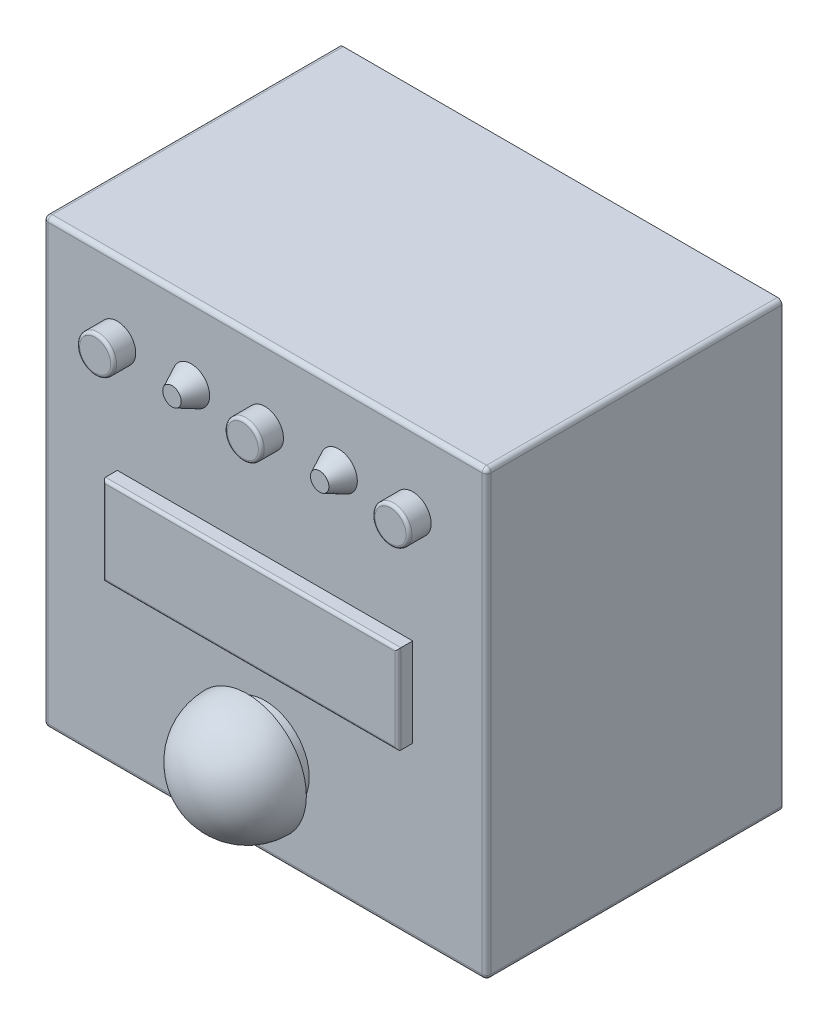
ISO-10303-21;
HEADER;
FILE_DESCRIPTION(('STEP AP214'),'2;1');
FILE_NAME('part.step','',(''),(''),'','','');
FILE_SCHEMA(('AUTOMOTIVE_DESIGN { 1 0 10303 214 1 1 1 1 }'));
ENDSEC;
DATA;
#1=APPLICATION_CONTEXT('core data for automotive mechanical design processes');
#2=APPLICATION_PROTOCOL_DEFINITION('international standard','automotive_design',2000,#1);
#3=PRODUCT_CONTEXT('',#1,'mechanical');
#4=PRODUCT('Part','Part','',(#3));
#5=PRODUCT_RELATED_PRODUCT_CATEGORY('part','',(#4));
#6=PRODUCT_DEFINITION_FORMATION('','',#4);
#7=PRODUCT_DEFINITION_CONTEXT('part definition',#1,'design');
#8=PRODUCT_DEFINITION('design','',#6,#7);
#9=PRODUCT_DEFINITION_SHAPE('','',#8);
#10=(LENGTH_UNIT() NAMED_UNIT(*) SI_UNIT(.MILLI.,.METRE.));
#11=(NAMED_UNIT(*) PLANE_ANGLE_UNIT() SI_UNIT($,.RADIAN.));
#12=(NAMED_UNIT(*) SI_UNIT($,.STERADIAN.) SOLID_ANGLE_UNIT());
#13=UNCERTAINTY_MEASURE_WITH_UNIT(LENGTH_MEASURE(1.E-05),#10,'distance_accuracy_value','');
#14=(GEOMETRIC_REPRESENTATION_CONTEXT(3) GLOBAL_UNCERTAINTY_ASSIGNED_CONTEXT((#13)) GLOBAL_UNIT_ASSIGNED_CONTEXT((#10,
#11,#12)) REPRESENTATION_CONTEXT('',''));
#15=CARTESIAN_POINT('',(0.,0.,0.));
#16=DIRECTION('',(0.,0.,1.));
#17=DIRECTION('',(1.,0.,0.));
#18=AXIS2_PLACEMENT_3D('',#15,#16,#17);
#19=CARTESIAN_POINT('',(0.,300.,200.));
#20=DIRECTION('',(0.,0.,-1.));
#21=DIRECTION('',(-1.,0.,0.));
#22=AXIS2_PLACEMENT_3D('',#19,#20,#21);
#23=PLANE('',#22);
#24=CARTESIAN_POINT('',(100.,250.,200.));
#25=DIRECTION('',(0.,0.,-1.));
#26=DIRECTION('',(-1.,0.,0.));
#27=AXIS2_PLACEMENT_3D('',#24,#25,#26);
#28=CIRCLE('',#27,12.5);
#29=CARTESIAN_POINT('',(87.5,250.,200.));
#30=VERTEX_POINT('',#29);
#31=EDGE_CURVE('E48',#30,#30,#28,.F.);
#32=ORIENTED_EDGE('',*,*,#31,.F.);
#33=EDGE_LOOP('',(#32));
#34=FACE_BOUND('',#33,.T.);
#35=DIRECTION('',(0.,-1.,0.));
#36=VECTOR('',#35,1.);
#37=CARTESIAN_POINT('',(3.,300.,200.));
#38=LINE('',#37,#36);
#39=CARTESIAN_POINT('',(3.,297.,200.));
#40=VERTEX_POINT('',#39);
#41=CARTESIAN_POINT('',(3.,3.,200.));
#42=VERTEX_POINT('',#41);
#43=EDGE_CURVE('E326',#40,#42,#38,.T.);
#44=ORIENTED_EDGE('',*,*,#43,.T.);
#45=DIRECTION('',(1.,0.,0.));
#46=VECTOR('',#45,1.);
#47=CARTESIAN_POINT('',(0.,3.,200.));
#48=LINE('',#47,#46);
#49=CARTESIAN_POINT('',(297.,3.,200.));
#50=VERTEX_POINT('',#49);
#51=EDGE_CURVE('E332',#42,#50,#48,.T.);
#52=ORIENTED_EDGE('',*,*,#51,.T.);
#53=DIRECTION('',(0.,1.,0.));
#54=VECTOR('',#53,1.);
#55=CARTESIAN_POINT('',(297.,300.,200.));
#56=LINE('',#55,#54);
#57=CARTESIAN_POINT('',(297.,297.,200.));
#58=VERTEX_POINT('',#57);
#59=EDGE_CURVE('E330',#50,#58,#56,.T.);
#60=ORIENTED_EDGE('',*,*,#59,.T.);
#61=DIRECTION('',(-1.,0.,0.));
#62=VECTOR('',#61,1.);
#63=CARTESIAN_POINT('',(0.,297.,200.));
#64=LINE('',#63,#62);
#65=EDGE_CURVE('E328',#58,#40,#64,.T.);
#66=ORIENTED_EDGE('',*,*,#65,.T.);
#67=EDGE_LOOP('',(#44,#52,#60,#66));
#68=FACE_BOUND('',#67,.T.);
#69=DIRECTION('',(0.,-1.,0.));
#70=VECTOR('',#69,1.);
#71=CARTESIAN_POINT('',(50.,175.,200.));
#72=LINE('',#71,#70);
#73=CARTESIAN_POINT('',(50.,175.,200.));
#74=VERTEX_POINT('',#73);
#75=CARTESIAN_POINT('',(50.,115.,200.));
#76=VERTEX_POINT('',#75);
#77=EDGE_CURVE('E180',#74,#76,#72,.T.);
#78=ORIENTED_EDGE('',*,*,#77,.F.);
#79=DIRECTION('',(-1.,0.,0.));
#80=VECTOR('',#79,1.);
#81=CARTESIAN_POINT('',(50.,175.,200.));
#82=LINE('',#81,#80);
#83=CARTESIAN_POINT('',(250.,175.,200.));
#84=VERTEX_POINT('',#83);
#85=EDGE_CURVE('E187',#84,#74,#82,.T.);
#86=ORIENTED_EDGE('',*,*,#85,.F.);
#87=DIRECTION('',(0.,1.,0.));
#88=VECTOR('',#87,1.);
#89=CARTESIAN_POINT('',(250.,175.,200.));
#90=LINE('',#89,#88);
#91=CARTESIAN_POINT('',(250.,115.,200.));
#92=VERTEX_POINT('',#91);
#93=EDGE_CURVE('E201',#92,#84,#90,.T.);
#94=ORIENTED_EDGE('',*,*,#93,.F.);
#95=DIRECTION('',(1.,0.,0.));
#96=VECTOR('',#95,1.);
#97=CARTESIAN_POINT('',(50.,115.,200.));
#98=LINE('',#97,#96);
#99=EDGE_CURVE('E196',#76,#92,#98,.T.);
#100=ORIENTED_EDGE('',*,*,#99,.F.);
#101=EDGE_LOOP('',(#78,#86,#94,#100));
#102=FACE_BOUND('',#101,.T.);
#103=CARTESIAN_POINT('',(150.,250.,200.));
#104=DIRECTION('',(0.,0.,-1.));
#105=DIRECTION('',(-1.,0.,0.));
#106=AXIS2_PLACEMENT_3D('',#103,#104,#105);
#107=CIRCLE('',#106,12.5);
#108=CARTESIAN_POINT('',(137.5,250.,200.));
#109=VERTEX_POINT('',#108);
#110=EDGE_CURVE('E255',#109,#109,#107,.F.);
#111=ORIENTED_EDGE('',*,*,#110,.F.);
#112=EDGE_LOOP('',(#111));
#113=FACE_BOUND('',#112,.T.);
#114=CARTESIAN_POINT('',(50.,250.,200.));
#115=DIRECTION('',(0.,0.,-1.));
#116=DIRECTION('',(-1.,0.,0.));
#117=AXIS2_PLACEMENT_3D('',#114,#115,#116);
#118=CIRCLE('',#117,12.5);
#119=CARTESIAN_POINT('',(37.5,250.,200.));
#120=VERTEX_POINT('',#119);
#121=EDGE_CURVE('E225',#120,#120,#118,.F.);
#122=ORIENTED_EDGE('',*,*,#121,.F.);
#123=EDGE_LOOP('',(#122));
#124=FACE_BOUND('',#123,.T.);
#125=CARTESIAN_POINT('',(250.,250.,200.));
#126=DIRECTION('',(0.,0.,-1.));
#127=DIRECTION('',(-1.,0.,0.));
#128=AXIS2_PLACEMENT_3D('',#125,#126,#127);
#129=CIRCLE('',#128,12.5);
#130=CARTESIAN_POINT('',(237.5,250.,200.));
#131=VERTEX_POINT('',#130);
#132=EDGE_CURVE('E258',#131,#131,#129,.F.);
#133=ORIENTED_EDGE('',*,*,#132,.F.);
#134=EDGE_LOOP('',(#133));
#135=FACE_BOUND('',#134,.T.);
#136=CARTESIAN_POINT('',(150.,60.,200.));
#137=DIRECTION('',(0.,0.,-1.));
#138=DIRECTION('',(-1.,0.,0.));
#139=AXIS2_PLACEMENT_3D('',#136,#137,#138);
#140=CIRCLE('',#139,30.);
#141=CARTESIAN_POINT('',(120.,60.,200.));
#142=VERTEX_POINT('',#141);
#143=EDGE_CURVE('E296',#142,#142,#140,.F.);
#144=ORIENTED_EDGE('',*,*,#143,.F.);
#145=EDGE_LOOP('',(#144));
#146=FACE_BOUND('',#145,.T.);
#147=CARTESIAN_POINT('',(200.,250.,200.));
#148=DIRECTION('',(0.,0.,-1.));
#149=DIRECTION('',(-1.,0.,0.));
#150=AXIS2_PLACEMENT_3D('',#147,#148,#149);
#151=CIRCLE('',#150,12.5);
#152=CARTESIAN_POINT('',(187.5,250.,200.));
#153=VERTEX_POINT('',#152);
#154=EDGE_CURVE('E13',#153,#153,#151,.F.);
#155=ORIENTED_EDGE('',*,*,#154,.F.);
#156=EDGE_LOOP('',(#155));
#157=FACE_BOUND('',#156,.T.);
#158=ADVANCED_FACE('F39',(#34,#68,#102,#113,#124,#135,#146,#157),#23,.F.);
#159=CARTESIAN_POINT('',(0.,0.,200.));
#160=DIRECTION('',(1.,0.,0.));
#161=DIRECTION('',(0.,0.,-1.));
#162=AXIS2_PLACEMENT_3D('',#159,#160,#161);
#163=PLANE('',#162);
#164=DIRECTION('',(0.,-1.,0.));
#165=VECTOR('',#164,1.);
#166=CARTESIAN_POINT('',(0.,0.,0.));
#167=LINE('',#166,#165);
#168=CARTESIAN_POINT('',(0.,297.,0.));
#169=VERTEX_POINT('',#168);
#170=CARTESIAN_POINT('',(0.,3.,0.));
#171=VERTEX_POINT('',#170);
#172=EDGE_CURVE('E211',#169,#171,#167,.T.);
#173=ORIENTED_EDGE('',*,*,#172,.T.);
#174=DIRECTION('',(0.,0.,-1.));
#175=VECTOR('',#174,1.);
#176=CARTESIAN_POINT('',(0.,3.,200.));
#177=LINE('',#176,#175);
#178=CARTESIAN_POINT('',(0.,3.,197.));
#179=VERTEX_POINT('',#178);
#180=EDGE_CURVE('E318',#171,#179,#177,.F.);
#181=ORIENTED_EDGE('',*,*,#180,.T.);
#182=DIRECTION('',(0.,-1.,0.));
#183=VECTOR('',#182,1.);
#184=CARTESIAN_POINT('',(0.,0.,197.));
#185=LINE('',#184,#183);
#186=CARTESIAN_POINT('',(0.,297.,197.));
#187=VERTEX_POINT('',#186);
#188=EDGE_CURVE('E314',#179,#187,#185,.F.);
#189=ORIENTED_EDGE('',*,*,#188,.T.);
#190=DIRECTION('',(0.,0.,-1.));
#191=VECTOR('',#190,1.);
#192=CARTESIAN_POINT('',(0.,297.,200.));
#193=LINE('',#192,#191);
#194=EDGE_CURVE('E316',#187,#169,#193,.T.);
#195=ORIENTED_EDGE('',*,*,#194,.T.);
#196=EDGE_LOOP('',(#173,#181,#189,#195));
#197=FACE_BOUND('',#196,.T.);
#198=ADVANCED_FACE('F345',(#197),#163,.F.);
#199=CARTESIAN_POINT('',(0.,0.,200.));
#200=DIRECTION('',(0.,1.,0.));
#201=DIRECTION('',(0.,0.,1.));
#202=AXIS2_PLACEMENT_3D('',#199,#200,#201);
#203=PLANE('',#202);
#204=DIRECTION('',(1.,0.,0.));
#205=VECTOR('',#204,1.);
#206=CARTESIAN_POINT('',(0.,0.,197.));
#207=LINE('',#206,#205);
#208=CARTESIAN_POINT('',(297.,0.,197.));
#209=VERTEX_POINT('',#208);
#210=CARTESIAN_POINT('',(3.,0.,197.));
#211=VERTEX_POINT('',#210);
#212=EDGE_CURVE('E299',#209,#211,#207,.F.);
#213=ORIENTED_EDGE('',*,*,#212,.T.);
#214=DIRECTION('',(0.,0.,-1.));
#215=VECTOR('',#214,1.);
#216=CARTESIAN_POINT('',(3.,0.,200.));
#217=LINE('',#216,#215);
#218=CARTESIAN_POINT('',(3.,0.,0.));
#219=VERTEX_POINT('',#218);
#220=EDGE_CURVE('E303',#211,#219,#217,.T.);
#221=ORIENTED_EDGE('',*,*,#220,.T.);
#222=DIRECTION('',(1.,0.,0.));
#223=VECTOR('',#222,1.);
#224=CARTESIAN_POINT('',(0.,0.,0.));
#225=LINE('',#224,#223);
#226=CARTESIAN_POINT('',(297.,0.,0.));
#227=VERTEX_POINT('',#226);
#228=EDGE_CURVE('E214',#219,#227,#225,.T.);
#229=ORIENTED_EDGE('',*,*,#228,.T.);
#230=DIRECTION('',(0.,0.,-1.));
#231=VECTOR('',#230,1.);
#232=CARTESIAN_POINT('',(297.,0.,200.));
#233=LINE('',#232,#231);
#234=EDGE_CURVE('E301',#227,#209,#233,.F.);
#235=ORIENTED_EDGE('',*,*,#234,.T.);
#236=EDGE_LOOP('',(#213,#221,#229,#235));
#237=FACE_BOUND('',#236,.T.);
#238=ADVANCED_FACE('F514',(#237),#203,.F.);
#239=CARTESIAN_POINT('',(300.,0.,200.));
#240=DIRECTION('',(-1.,0.,0.));
#241=DIRECTION('',(0.,0.,1.));
#242=AXIS2_PLACEMENT_3D('',#239,#240,#241);
#243=PLANE('',#242);
#244=DIRECTION('',(0.,1.,0.));
#245=VECTOR('',#244,1.);
#246=CARTESIAN_POINT('',(300.,0.,197.));
#247=LINE('',#246,#245);
#248=CARTESIAN_POINT('',(300.,297.,197.));
#249=VERTEX_POINT('',#248);
#250=CARTESIAN_POINT('',(300.,3.,197.));
#251=VERTEX_POINT('',#250);
#252=EDGE_CURVE('E322',#249,#251,#247,.F.);
#253=ORIENTED_EDGE('',*,*,#252,.T.);
#254=DIRECTION('',(0.,0.,-1.));
#255=VECTOR('',#254,1.);
#256=CARTESIAN_POINT('',(300.,3.,200.));
#257=LINE('',#256,#255);
#258=CARTESIAN_POINT('',(300.,3.,0.));
#259=VERTEX_POINT('',#258);
#260=EDGE_CURVE('E324',#251,#259,#257,.T.);
#261=ORIENTED_EDGE('',*,*,#260,.T.);
#262=DIRECTION('',(0.,1.,0.));
#263=VECTOR('',#262,1.);
#264=CARTESIAN_POINT('',(300.,0.,0.));
#265=LINE('',#264,#263);
#266=CARTESIAN_POINT('',(300.,297.,0.));
#267=VERTEX_POINT('',#266);
#268=EDGE_CURVE('E217',#259,#267,#265,.T.);
#269=ORIENTED_EDGE('',*,*,#268,.T.);
#270=DIRECTION('',(0.,0.,-1.));
#271=VECTOR('',#270,1.);
#272=CARTESIAN_POINT('',(300.,297.,200.));
#273=LINE('',#272,#271);
#274=EDGE_CURVE('E320',#267,#249,#273,.F.);
#275=ORIENTED_EDGE('',*,*,#274,.T.);
#276=EDGE_LOOP('',(#253,#261,#269,#275));
#277=FACE_BOUND('',#276,.T.);
#278=ADVANCED_FACE('F511',(#277),#243,.F.);
#279=CARTESIAN_POINT('',(0.,300.,200.));
#280=DIRECTION('',(0.,-1.,0.));
#281=DIRECTION('',(0.,0.,-1.));
#282=AXIS2_PLACEMENT_3D('',#279,#280,#281);
#283=PLANE('',#282);
#284=DIRECTION('',(-1.,0.,0.));
#285=VECTOR('',#284,1.);
#286=CARTESIAN_POINT('',(0.,300.,197.));
#287=LINE('',#286,#285);
#288=CARTESIAN_POINT('',(3.,300.,197.));
#289=VERTEX_POINT('',#288);
#290=CARTESIAN_POINT('',(297.,300.,197.));
#291=VERTEX_POINT('',#290);
#292=EDGE_CURVE('E55',#289,#291,#287,.F.);
#293=ORIENTED_EDGE('',*,*,#292,.T.);
#294=DIRECTION('',(0.,0.,-1.));
#295=VECTOR('',#294,1.);
#296=CARTESIAN_POINT('',(297.,300.,200.));
#297=LINE('',#296,#295);
#298=CARTESIAN_POINT('',(297.,300.,0.));
#299=VERTEX_POINT('',#298);
#300=EDGE_CURVE('E337',#291,#299,#297,.T.);
#301=ORIENTED_EDGE('',*,*,#300,.T.);
#302=DIRECTION('',(-1.,0.,0.));
#303=VECTOR('',#302,1.);
#304=CARTESIAN_POINT('',(0.,300.,0.));
#305=LINE('',#304,#303);
#306=CARTESIAN_POINT('',(3.,300.,0.));
#307=VERTEX_POINT('',#306);
#308=EDGE_CURVE('E220',#299,#307,#305,.T.);
#309=ORIENTED_EDGE('',*,*,#308,.T.);
#310=DIRECTION('',(0.,0.,-1.));
#311=VECTOR('',#310,1.);
#312=CARTESIAN_POINT('',(3.,300.,200.));
#313=LINE('',#312,#311);
#314=EDGE_CURVE('E60',#307,#289,#313,.F.);
#315=ORIENTED_EDGE('',*,*,#314,.T.);
#316=EDGE_LOOP('',(#293,#301,#309,#315));
#317=FACE_BOUND('',#316,.T.);
#318=ADVANCED_FACE('F506',(#317),#283,.F.);
#319=CARTESIAN_POINT('',(0.,300.,0.));
#320=DIRECTION('',(0.,0.,-1.));
#321=DIRECTION('',(-1.,0.,0.));
#322=AXIS2_PLACEMENT_3D('',#319,#320,#321);
#323=PLANE('',#322);
#324=ORIENTED_EDGE('',*,*,#228,.F.);
#325=CARTESIAN_POINT('',(3.,3.,0.));
#326=DIRECTION('',(0.,0.,-1.));
#327=DIRECTION('',(-1.,0.,0.));
#328=AXIS2_PLACEMENT_3D('',#325,#326,#327);
#329=CIRCLE('',#328,3.);
#330=EDGE_CURVE('E312',#219,#171,#329,.T.);
#331=ORIENTED_EDGE('',*,*,#330,.T.);
#332=ORIENTED_EDGE('',*,*,#172,.F.);
#333=CARTESIAN_POINT('',(3.,297.,0.));
#334=DIRECTION('',(0.,0.,-1.));
#335=DIRECTION('',(-1.,0.,0.));
#336=AXIS2_PLACEMENT_3D('',#333,#334,#335);
#337=CIRCLE('',#336,3.);
#338=EDGE_CURVE('E306',#169,#307,#337,.T.);
#339=ORIENTED_EDGE('',*,*,#338,.T.);
#340=ORIENTED_EDGE('',*,*,#308,.F.);
#341=CARTESIAN_POINT('',(297.,297.,0.));
#342=DIRECTION('',(0.,0.,-1.));
#343=DIRECTION('',(-1.,0.,0.));
#344=AXIS2_PLACEMENT_3D('',#341,#342,#343);
#345=CIRCLE('',#344,3.);
#346=EDGE_CURVE('E308',#299,#267,#345,.T.);
#347=ORIENTED_EDGE('',*,*,#346,.T.);
#348=ORIENTED_EDGE('',*,*,#268,.F.);
#349=CARTESIAN_POINT('',(297.,3.,0.));
#350=DIRECTION('',(0.,0.,-1.));
#351=DIRECTION('',(-1.,0.,0.));
#352=AXIS2_PLACEMENT_3D('',#349,#350,#351);
#353=CIRCLE('',#352,3.);
#354=EDGE_CURVE('E310',#259,#227,#353,.T.);
#355=ORIENTED_EDGE('',*,*,#354,.T.);
#356=EDGE_LOOP('',(#324,#331,#332,#339,#340,#347,#348,#355));
#357=FACE_BOUND('',#356,.T.);
#358=ADVANCED_FACE('F503',(#357),#323,.T.);
#359=CARTESIAN_POINT('',(50.,250.,215.));
#360=DIRECTION('',(0.,0.,-1.));
#361=DIRECTION('',(-1.,0.,0.));
#362=AXIS2_PLACEMENT_3D('',#359,#360,#361);
#363=CYLINDRICAL_SURFACE('',#362,12.5);
#364=CARTESIAN_POINT('',(50.,250.,213.));
#365=DIRECTION('',(0.,0.,1.));
#366=DIRECTION('',(1.,0.,0.));
#367=AXIS2_PLACEMENT_3D('',#364,#365,#366);
#368=CIRCLE('',#367,12.5);
#369=CARTESIAN_POINT('',(62.5,250.,213.));
#370=VERTEX_POINT('',#369);
#371=EDGE_CURVE('E276',#370,#370,#368,.F.);
#372=ORIENTED_EDGE('',*,*,#371,.T.);
#373=EDGE_LOOP('',(#372));
#374=FACE_BOUND('',#373,.T.);
#375=ORIENTED_EDGE('',*,*,#121,.T.);
#376=EDGE_LOOP('',(#375));
#377=FACE_BOUND('',#376,.T.);
#378=ADVANCED_FACE('F499',(#374,#377),#363,.T.);
#379=CARTESIAN_POINT('',(50.,250.,215.));
#380=DIRECTION('',(0.,0.,1.));
#381=DIRECTION('',(1.,0.,0.));
#382=AXIS2_PLACEMENT_3D('',#379,#380,#381);
#383=PLANE('',#382);
#384=CARTESIAN_POINT('',(50.,250.,215.));
#385=DIRECTION('',(0.,0.,1.));
#386=DIRECTION('',(1.,0.,0.));
#387=AXIS2_PLACEMENT_3D('',#384,#385,#386);
#388=CIRCLE('',#387,10.5);
#389=CARTESIAN_POINT('',(60.5,250.,215.));
#390=VERTEX_POINT('',#389);
#391=EDGE_CURVE('E273',#390,#390,#388,.T.);
#392=ORIENTED_EDGE('',*,*,#391,.T.);
#393=EDGE_LOOP('',(#392));
#394=FACE_BOUND('',#393,.T.);
#395=ADVANCED_FACE('F495',(#394),#383,.T.);
#396=CARTESIAN_POINT('',(150.,250.,215.));
#397=DIRECTION('',(0.,0.,-1.));
#398=DIRECTION('',(-1.,0.,0.));
#399=AXIS2_PLACEMENT_3D('',#396,#397,#398);
#400=CYLINDRICAL_SURFACE('',#399,12.5);
#401=CARTESIAN_POINT('',(150.,250.,213.));
#402=DIRECTION('',(0.,0.,1.));
#403=DIRECTION('',(1.,0.,0.));
#404=AXIS2_PLACEMENT_3D('',#401,#402,#403);
#405=CIRCLE('',#404,12.5);
#406=CARTESIAN_POINT('',(162.5,250.,213.));
#407=VERTEX_POINT('',#406);
#408=EDGE_CURVE('E270',#407,#407,#405,.F.);
#409=ORIENTED_EDGE('',*,*,#408,.T.);
#410=EDGE_LOOP('',(#409));
#411=FACE_BOUND('',#410,.T.);
#412=ORIENTED_EDGE('',*,*,#110,.T.);
#413=EDGE_LOOP('',(#412));
#414=FACE_BOUND('',#413,.T.);
#415=ADVANCED_FACE('F491',(#411,#414),#400,.T.);
#416=CARTESIAN_POINT('',(150.,250.,215.));
#417=DIRECTION('',(0.,0.,1.));
#418=DIRECTION('',(1.,0.,0.));
#419=AXIS2_PLACEMENT_3D('',#416,#417,#418);
#420=PLANE('',#419);
#421=CARTESIAN_POINT('',(150.,250.,215.));
#422=DIRECTION('',(0.,0.,1.));
#423=DIRECTION('',(1.,0.,0.));
#424=AXIS2_PLACEMENT_3D('',#421,#422,#423);
#425=CIRCLE('',#424,10.5);
#426=CARTESIAN_POINT('',(160.5,250.,215.));
#427=VERTEX_POINT('',#426);
#428=EDGE_CURVE('E267',#427,#427,#425,.T.);
#429=ORIENTED_EDGE('',*,*,#428,.T.);
#430=EDGE_LOOP('',(#429));
#431=FACE_BOUND('',#430,.T.);
#432=ADVANCED_FACE('F487',(#431),#420,.T.);
#433=CARTESIAN_POINT('',(250.,250.,215.));
#434=DIRECTION('',(0.,0.,-1.));
#435=DIRECTION('',(-1.,0.,0.));
#436=AXIS2_PLACEMENT_3D('',#433,#434,#435);
#437=CYLINDRICAL_SURFACE('',#436,12.5);
#438=CARTESIAN_POINT('',(250.,250.,213.));
#439=DIRECTION('',(0.,0.,1.));
#440=DIRECTION('',(1.,0.,0.));
#441=AXIS2_PLACEMENT_3D('',#438,#439,#440);
#442=CIRCLE('',#441,12.5);
#443=CARTESIAN_POINT('',(262.5,250.,213.));
#444=VERTEX_POINT('',#443);
#445=EDGE_CURVE('E264',#444,#444,#442,.F.);
#446=ORIENTED_EDGE('',*,*,#445,.T.);
#447=EDGE_LOOP('',(#446));
#448=FACE_BOUND('',#447,.T.);
#449=ORIENTED_EDGE('',*,*,#132,.T.);
#450=EDGE_LOOP('',(#449));
#451=FACE_BOUND('',#450,.T.);
#452=ADVANCED_FACE('F483',(#448,#451),#437,.T.);
#453=CARTESIAN_POINT('',(250.,250.,215.));
#454=DIRECTION('',(0.,0.,1.));
#455=DIRECTION('',(1.,0.,0.));
#456=AXIS2_PLACEMENT_3D('',#453,#454,#455);
#457=PLANE('',#456);
#458=CARTESIAN_POINT('',(250.,250.,215.));
#459=DIRECTION('',(0.,0.,1.));
#460=DIRECTION('',(1.,0.,0.));
#461=AXIS2_PLACEMENT_3D('',#458,#459,#460);
#462=CIRCLE('',#461,10.5);
#463=CARTESIAN_POINT('',(260.5,250.,215.));
#464=VERTEX_POINT('',#463);
#465=EDGE_CURVE('E261',#464,#464,#462,.T.);
#466=ORIENTED_EDGE('',*,*,#465,.T.);
#467=EDGE_LOOP('',(#466));
#468=FACE_BOUND('',#467,.T.);
#469=ADVANCED_FACE('F479',(#468),#457,.T.);
#470=CARTESIAN_POINT('',(250.,250.,213.));
#471=DIRECTION('',(0.,0.,1.));
#472=DIRECTION('',(1.,0.,0.));
#473=AXIS2_PLACEMENT_3D('',#470,#471,#472);
#474=TOROIDAL_SURFACE('',#473,10.5,2.);
#475=ORIENTED_EDGE('',*,*,#445,.F.);
#476=EDGE_LOOP('',(#475));
#477=FACE_BOUND('',#476,.T.);
#478=ORIENTED_EDGE('',*,*,#465,.F.);
#479=EDGE_LOOP('',(#478));
#480=FACE_BOUND('',#479,.T.);
#481=ADVANCED_FACE('F475',(#477,#480),#474,.T.);
#482=CARTESIAN_POINT('',(150.,250.,213.));
#483=DIRECTION('',(0.,0.,1.));
#484=DIRECTION('',(1.,0.,0.));
#485=AXIS2_PLACEMENT_3D('',#482,#483,#484);
#486=TOROIDAL_SURFACE('',#485,10.5,2.);
#487=ORIENTED_EDGE('',*,*,#408,.F.);
#488=EDGE_LOOP('',(#487));
#489=FACE_BOUND('',#488,.T.);
#490=ORIENTED_EDGE('',*,*,#428,.F.);
#491=EDGE_LOOP('',(#490));
#492=FACE_BOUND('',#491,.T.);
#493=ADVANCED_FACE('F471',(#489,#492),#486,.T.);
#494=CARTESIAN_POINT('',(50.,250.,213.));
#495=DIRECTION('',(0.,0.,1.));
#496=DIRECTION('',(1.,0.,0.));
#497=AXIS2_PLACEMENT_3D('',#494,#495,#496);
#498=TOROIDAL_SURFACE('',#497,10.5,2.);
#499=ORIENTED_EDGE('',*,*,#371,.F.);
#500=EDGE_LOOP('',(#499));
#501=FACE_BOUND('',#500,.T.);
#502=ORIENTED_EDGE('',*,*,#391,.F.);
#503=EDGE_LOOP('',(#502));
#504=FACE_BOUND('',#503,.T.);
#505=ADVANCED_FACE('F468',(#501,#504),#498,.T.);
#506=CARTESIAN_POINT('',(50.,175.,210.));
#507=DIRECTION('',(1.,0.,0.));
#508=DIRECTION('',(0.,1.,0.));
#509=AXIS2_PLACEMENT_3D('',#506,#507,#508);
#510=PLANE('',#509);
#511=DIRECTION('',(0.,0.,-1.));
#512=VECTOR('',#511,1.);
#513=CARTESIAN_POINT('',(50.,115.,210.));
#514=LINE('',#513,#512);
#515=CARTESIAN_POINT('',(50.,115.,208.));
#516=VERTEX_POINT('',#515);
#517=EDGE_CURVE('E209',#516,#76,#514,.T.);
#518=ORIENTED_EDGE('',*,*,#517,.F.);
#519=DIRECTION('',(0.,-1.,0.));
#520=VECTOR('',#519,1.);
#521=CARTESIAN_POINT('',(50.,175.,208.));
#522=LINE('',#521,#520);
#523=CARTESIAN_POINT('',(50.,175.,208.));
#524=VERTEX_POINT('',#523);
#525=EDGE_CURVE('E182',#516,#524,#522,.F.);
#526=ORIENTED_EDGE('',*,*,#525,.T.);
#527=DIRECTION('',(0.,0.,-1.));
#528=VECTOR('',#527,1.);
#529=CARTESIAN_POINT('',(50.,175.,210.));
#530=LINE('',#529,#528);
#531=EDGE_CURVE('E176',#524,#74,#530,.T.);
#532=ORIENTED_EDGE('',*,*,#531,.T.);
#533=ORIENTED_EDGE('',*,*,#77,.T.);
#534=EDGE_LOOP('',(#518,#526,#532,#533));
#535=FACE_BOUND('',#534,.T.);
#536=ADVANCED_FACE('F179',(#535),#510,.F.);
#537=CARTESIAN_POINT('',(50.,115.,210.));
#538=DIRECTION('',(0.,1.,0.));
#539=DIRECTION('',(0.,0.,1.));
#540=AXIS2_PLACEMENT_3D('',#537,#538,#539);
#541=PLANE('',#540);
#542=DIRECTION('',(0.,0.,-1.));
#543=VECTOR('',#542,1.);
#544=CARTESIAN_POINT('',(250.,115.,210.));
#545=LINE('',#544,#543);
#546=CARTESIAN_POINT('',(250.,115.,208.));
#547=VERTEX_POINT('',#546);
#548=EDGE_CURVE('E207',#547,#92,#545,.T.);
#549=ORIENTED_EDGE('',*,*,#548,.F.);
#550=DIRECTION('',(1.,0.,0.));
#551=VECTOR('',#550,1.);
#552=CARTESIAN_POINT('',(50.,115.,208.));
#553=LINE('',#552,#551);
#554=EDGE_CURVE('E291',#547,#516,#553,.F.);
#555=ORIENTED_EDGE('',*,*,#554,.T.);
#556=ORIENTED_EDGE('',*,*,#517,.T.);
#557=ORIENTED_EDGE('',*,*,#99,.T.);
#558=EDGE_LOOP('',(#549,#555,#556,#557));
#559=FACE_BOUND('',#558,.T.);
#560=ADVANCED_FACE('F418',(#559),#541,.F.);
#561=CARTESIAN_POINT('',(250.,175.,210.));
#562=DIRECTION('',(-1.,0.,0.));
#563=DIRECTION('',(0.,0.,1.));
#564=AXIS2_PLACEMENT_3D('',#561,#562,#563);
#565=PLANE('',#564);
#566=DIRECTION('',(0.,0.,-1.));
#567=VECTOR('',#566,1.);
#568=CARTESIAN_POINT('',(250.,175.,210.));
#569=LINE('',#568,#567);
#570=CARTESIAN_POINT('',(250.,175.,208.));
#571=VERTEX_POINT('',#570);
#572=EDGE_CURVE('E186',#571,#84,#569,.T.);
#573=ORIENTED_EDGE('',*,*,#572,.F.);
#574=DIRECTION('',(0.,1.,0.));
#575=VECTOR('',#574,1.);
#576=CARTESIAN_POINT('',(250.,115.,208.));
#577=LINE('',#576,#575);
#578=EDGE_CURVE('E288',#571,#547,#577,.F.);
#579=ORIENTED_EDGE('',*,*,#578,.T.);
#580=ORIENTED_EDGE('',*,*,#548,.T.);
#581=ORIENTED_EDGE('',*,*,#93,.T.);
#582=EDGE_LOOP('',(#573,#579,#580,#581));
#583=FACE_BOUND('',#582,.T.);
#584=ADVANCED_FACE('F438',(#583),#565,.F.);
#585=CARTESIAN_POINT('',(50.,175.,210.));
#586=DIRECTION('',(0.,-1.,0.));
#587=DIRECTION('',(0.,0.,-1.));
#588=AXIS2_PLACEMENT_3D('',#585,#586,#587);
#589=PLANE('',#588);
#590=ORIENTED_EDGE('',*,*,#531,.F.);
#591=DIRECTION('',(-1.,0.,0.));
#592=VECTOR('',#591,1.);
#593=CARTESIAN_POINT('',(250.,175.,208.));
#594=LINE('',#593,#592);
#595=EDGE_CURVE('E293',#524,#571,#594,.F.);
#596=ORIENTED_EDGE('',*,*,#595,.T.);
#597=ORIENTED_EDGE('',*,*,#572,.T.);
#598=ORIENTED_EDGE('',*,*,#85,.T.);
#599=EDGE_LOOP('',(#590,#596,#597,#598));
#600=FACE_BOUND('',#599,.T.);
#601=ADVANCED_FACE('F199',(#600),#589,.F.);
#602=CARTESIAN_POINT('',(50.,115.,210.));
#603=DIRECTION('',(0.,0.,1.));
#604=DIRECTION('',(1.,0.,0.));
#605=AXIS2_PLACEMENT_3D('',#602,#603,#604);
#606=PLANE('',#605);
#607=DIRECTION('',(1.,0.,0.));
#608=VECTOR('',#607,1.);
#609=CARTESIAN_POINT('',(250.,117.,210.));
#610=LINE('',#609,#608);
#611=CARTESIAN_POINT('',(52.,117.,210.));
#612=VERTEX_POINT('',#611);
#613=CARTESIAN_POINT('',(248.,117.,210.));
#614=VERTEX_POINT('',#613);
#615=EDGE_CURVE('E283',#612,#614,#610,.T.);
#616=ORIENTED_EDGE('',*,*,#615,.T.);
#617=DIRECTION('',(0.,1.,0.));
#618=VECTOR('',#617,1.);
#619=CARTESIAN_POINT('',(248.,175.,210.));
#620=LINE('',#619,#618);
#621=CARTESIAN_POINT('',(248.,173.,210.));
#622=VERTEX_POINT('',#621);
#623=EDGE_CURVE('E285',#614,#622,#620,.T.);
#624=ORIENTED_EDGE('',*,*,#623,.T.);
#625=DIRECTION('',(-1.,0.,0.));
#626=VECTOR('',#625,1.);
#627=CARTESIAN_POINT('',(50.,173.,210.));
#628=LINE('',#627,#626);
#629=CARTESIAN_POINT('',(52.,173.,210.));
#630=VERTEX_POINT('',#629);
#631=EDGE_CURVE('E281',#622,#630,#628,.T.);
#632=ORIENTED_EDGE('',*,*,#631,.T.);
#633=DIRECTION('',(0.,-1.,0.));
#634=VECTOR('',#633,1.);
#635=CARTESIAN_POINT('',(52.,115.,210.));
#636=LINE('',#635,#634);
#637=EDGE_CURVE('E279',#630,#612,#636,.T.);
#638=ORIENTED_EDGE('',*,*,#637,.T.);
#639=EDGE_LOOP('',(#616,#624,#632,#638));
#640=FACE_BOUND('',#639,.T.);
#641=ADVANCED_FACE('F431',(#640),#606,.T.);
#642=CARTESIAN_POINT('',(52.,115.,208.));
#643=DIRECTION('',(0.,1.,0.));
#644=DIRECTION('',(-1.,0.,0.));
#645=AXIS2_PLACEMENT_3D('',#642,#643,#644);
#646=CYLINDRICAL_SURFACE('',#645,2.);
#647=CARTESIAN_POINT('',(52.,173.,208.));
#648=DIRECTION('',(0.707106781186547,0.707106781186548,0.));
#649=DIRECTION('',(-0.707106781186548,0.707106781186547,0.));
#650=AXIS2_PLACEMENT_3D('',#647,#648,#649);
#651=ELLIPSE('',#650,2.82842712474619,2.);
#652=EDGE_CURVE('E412',#524,#630,#651,.T.);
#653=ORIENTED_EDGE('',*,*,#652,.F.);
#654=ORIENTED_EDGE('',*,*,#525,.F.);
#655=CARTESIAN_POINT('',(52.,117.,208.));
#656=DIRECTION('',(-0.707106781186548,0.707106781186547,0.));
#657=DIRECTION('',(0.707106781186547,0.707106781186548,0.));
#658=AXIS2_PLACEMENT_3D('',#655,#656,#657);
#659=ELLIPSE('',#658,2.82842712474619,2.);
#660=EDGE_CURVE('E197',#612,#516,#659,.F.);
#661=ORIENTED_EDGE('',*,*,#660,.F.);
#662=ORIENTED_EDGE('',*,*,#637,.F.);
#663=EDGE_LOOP('',(#653,#654,#661,#662));
#664=FACE_BOUND('',#663,.T.);
#665=ADVANCED_FACE('F422',(#664),#646,.T.);
#666=CARTESIAN_POINT('',(50.,117.,208.));
#667=DIRECTION('',(-1.,0.,0.));
#668=DIRECTION('',(0.,0.,1.));
#669=AXIS2_PLACEMENT_3D('',#666,#667,#668);
#670=CYLINDRICAL_SURFACE('',#669,2.);
#671=ORIENTED_EDGE('',*,*,#660,.T.);
#672=ORIENTED_EDGE('',*,*,#554,.F.);
#673=CARTESIAN_POINT('',(248.,117.,208.));
#674=DIRECTION('',(-0.707106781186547,-0.707106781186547,0.));
#675=DIRECTION('',(-0.707106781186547,0.707106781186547,0.));
#676=AXIS2_PLACEMENT_3D('',#673,#674,#675);
#677=ELLIPSE('',#676,2.82842712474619,2.);
#678=EDGE_CURVE('E410',#614,#547,#677,.F.);
#679=ORIENTED_EDGE('',*,*,#678,.F.);
#680=ORIENTED_EDGE('',*,*,#615,.F.);
#681=EDGE_LOOP('',(#671,#672,#679,#680));
#682=FACE_BOUND('',#681,.T.);
#683=ADVANCED_FACE('F427',(#682),#670,.T.);
#684=CARTESIAN_POINT('',(50.,173.,208.));
#685=DIRECTION('',(1.,0.,0.));
#686=DIRECTION('',(0.,0.,-1.));
#687=AXIS2_PLACEMENT_3D('',#684,#685,#686);
#688=CYLINDRICAL_SURFACE('',#687,2.);
#689=ORIENTED_EDGE('',*,*,#652,.T.);
#690=ORIENTED_EDGE('',*,*,#631,.F.);
#691=CARTESIAN_POINT('',(248.,173.,208.));
#692=DIRECTION('',(0.707106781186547,-0.707106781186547,0.));
#693=DIRECTION('',(0.707106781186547,0.707106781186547,0.));
#694=AXIS2_PLACEMENT_3D('',#691,#692,#693);
#695=ELLIPSE('',#694,2.82842712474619,2.);
#696=EDGE_CURVE('E408',#571,#622,#695,.T.);
#697=ORIENTED_EDGE('',*,*,#696,.F.);
#698=ORIENTED_EDGE('',*,*,#595,.F.);
#699=EDGE_LOOP('',(#689,#690,#697,#698));
#700=FACE_BOUND('',#699,.T.);
#701=ADVANCED_FACE('F434',(#700),#688,.T.);
#702=CARTESIAN_POINT('',(248.,115.,208.));
#703=DIRECTION('',(0.,-1.,0.));
#704=DIRECTION('',(0.,0.,-1.));
#705=AXIS2_PLACEMENT_3D('',#702,#703,#704);
#706=CYLINDRICAL_SURFACE('',#705,2.);
#707=ORIENTED_EDGE('',*,*,#678,.T.);
#708=ORIENTED_EDGE('',*,*,#578,.F.);
#709=ORIENTED_EDGE('',*,*,#696,.T.);
#710=ORIENTED_EDGE('',*,*,#623,.F.);
#711=EDGE_LOOP('',(#707,#708,#709,#710));
#712=FACE_BOUND('',#711,.T.);
#713=ADVANCED_FACE('F440',(#712),#706,.T.);
#714=CARTESIAN_POINT('',(150.,60.,212.));
#715=DIRECTION('',(0.,0.,-1.));
#716=DIRECTION('',(-1.,0.,0.));
#717=AXIS2_PLACEMENT_3D('',#714,#715,#716);
#718=CYLINDRICAL_SURFACE('',#717,30.);
#719=CARTESIAN_POINT('',(150.,60.,212.));
#720=DIRECTION('',(0.,0.,1.));
#721=DIRECTION('',(1.,0.,0.));
#722=AXIS2_PLACEMENT_3D('',#719,#720,#721);
#723=CIRCLE('',#722,30.);
#724=CARTESIAN_POINT('',(180.,60.,212.));
#725=VERTEX_POINT('',#724);
#726=EDGE_CURVE('E405',#725,#725,#723,.T.);
#727=ORIENTED_EDGE('',*,*,#726,.F.);
#728=EDGE_LOOP('',(#727));
#729=FACE_BOUND('',#728,.T.);
#730=ORIENTED_EDGE('',*,*,#143,.T.);
#731=EDGE_LOOP('',(#730));
#732=FACE_BOUND('',#731,.T.);
#733=ADVANCED_FACE('F442',(#729,#732),#718,.T.);
#734=CARTESIAN_POINT('',(150.,60.,212.));
#735=DIRECTION('',(0.,0.,-1.));
#736=DIRECTION('',(1.,0.,0.));
#737=AXIS2_PLACEMENT_3D('',#734,#735,#736);
#738=PLANE('',#737);
#739=CARTESIAN_POINT('',(150.,60.,212.));
#740=DIRECTION('',(0.,0.,-1.));
#741=DIRECTION('',(1.,0.,0.));
#742=AXIS2_PLACEMENT_3D('',#739,#740,#741);
#743=CIRCLE('',#742,40.);
#744=CARTESIAN_POINT('',(190.,60.,212.));
#745=VERTEX_POINT('',#744);
#746=EDGE_CURVE('E402',#745,#745,#743,.T.);
#747=ORIENTED_EDGE('',*,*,#746,.T.);
#748=EDGE_LOOP('',(#747));
#749=FACE_BOUND('',#748,.T.);
#750=ORIENTED_EDGE('',*,*,#726,.T.);
#751=EDGE_LOOP('',(#750));
#752=FACE_BOUND('',#751,.T.);
#753=ADVANCED_FACE('F448',(#749,#752),#738,.T.);
#754=CARTESIAN_POINT('',(150.,60.,212.));
#755=DIRECTION('',(-1.,0.,0.));
#756=DIRECTION('',(0.,-1.,0.));
#757=AXIS2_PLACEMENT_3D('',#754,#755,#756);
#758=SPHERICAL_SURFACE('',#757,40.);
#759=CARTESIAN_POINT('',(150.,60.,212.));
#760=DIRECTION('',(0.,0.,-1.));
#761=DIRECTION('',(1.,0.,0.));
#762=AXIS2_PLACEMENT_3D('',#759,#760,#761);
#763=SPHERICAL_SURFACE('',#762,40.);
#764=ORIENTED_EDGE('',*,*,#746,.F.);
#765=EDGE_LOOP('',(#764));
#766=FACE_BOUND('',#765,.T.);
#767=ADVANCED_FACE('F638',(#766),#763,.T.);
#768=CARTESIAN_POINT('',(297.,297.,200.));
#769=DIRECTION('',(0.,0.,-1.));
#770=DIRECTION('',(-1.,0.,0.));
#771=AXIS2_PLACEMENT_3D('',#768,#769,#770);
#772=CYLINDRICAL_SURFACE('',#771,3.);
#773=CARTESIAN_POINT('',(297.,297.,197.));
#774=DIRECTION('',(0.,0.,1.));
#775=DIRECTION('',(1.,0.,0.));
#776=AXIS2_PLACEMENT_3D('',#773,#774,#775);
#777=CIRCLE('',#776,3.);
#778=EDGE_CURVE('E399',#249,#291,#777,.T.);
#779=ORIENTED_EDGE('',*,*,#778,.F.);
#780=ORIENTED_EDGE('',*,*,#274,.F.);
#781=ORIENTED_EDGE('',*,*,#346,.F.);
#782=ORIENTED_EDGE('',*,*,#300,.F.);
#783=EDGE_LOOP('',(#779,#780,#781,#782));
#784=FACE_BOUND('',#783,.T.);
#785=ADVANCED_FACE('F649',(#784),#772,.T.);
#786=CARTESIAN_POINT('',(297.,297.,197.));
#787=DIRECTION('',(0.,0.,1.));
#788=DIRECTION('',(1.,0.,0.));
#789=AXIS2_PLACEMENT_3D('',#786,#787,#788);
#790=SPHERICAL_SURFACE('',#789,3.);
#791=CARTESIAN_POINT('',(297.,297.,197.));
#792=DIRECTION('',(0.,1.,0.));
#793=DIRECTION('',(0.,0.,1.));
#794=AXIS2_PLACEMENT_3D('',#791,#792,#793);
#795=CIRCLE('',#794,3.);
#796=EDGE_CURVE('E393',#249,#58,#795,.F.);
#797=ORIENTED_EDGE('',*,*,#796,.F.);
#798=ORIENTED_EDGE('',*,*,#778,.T.);
#799=CARTESIAN_POINT('',(297.,297.,197.));
#800=DIRECTION('',(1.,0.,0.));
#801=DIRECTION('',(0.,0.,-1.));
#802=AXIS2_PLACEMENT_3D('',#799,#800,#801);
#803=CIRCLE('',#802,3.);
#804=EDGE_CURVE('E396',#58,#291,#803,.F.);
#805=ORIENTED_EDGE('',*,*,#804,.F.);
#806=EDGE_LOOP('',(#797,#798,#805));
#807=FACE_BOUND('',#806,.T.);
#808=ADVANCED_FACE('F656',(#807),#790,.T.);
#809=CARTESIAN_POINT('',(3.,297.,200.));
#810=DIRECTION('',(0.,0.,-1.));
#811=DIRECTION('',(-1.,0.,0.));
#812=AXIS2_PLACEMENT_3D('',#809,#810,#811);
#813=CYLINDRICAL_SURFACE('',#812,3.);
#814=ORIENTED_EDGE('',*,*,#338,.F.);
#815=ORIENTED_EDGE('',*,*,#194,.F.);
#816=CARTESIAN_POINT('',(3.,297.,197.));
#817=DIRECTION('',(0.,0.,1.));
#818=DIRECTION('',(1.,0.,0.));
#819=AXIS2_PLACEMENT_3D('',#816,#817,#818);
#820=CIRCLE('',#819,3.);
#821=EDGE_CURVE('E390',#289,#187,#820,.T.);
#822=ORIENTED_EDGE('',*,*,#821,.F.);
#823=ORIENTED_EDGE('',*,*,#314,.F.);
#824=EDGE_LOOP('',(#814,#815,#822,#823));
#825=FACE_BOUND('',#824,.T.);
#826=ADVANCED_FACE('F664',(#825),#813,.T.);
#827=CARTESIAN_POINT('',(0.,297.,197.));
#828=DIRECTION('',(-1.,0.,0.));
#829=DIRECTION('',(0.,0.,1.));
#830=AXIS2_PLACEMENT_3D('',#827,#828,#829);
#831=CYLINDRICAL_SURFACE('',#830,3.);
#832=ORIENTED_EDGE('',*,*,#804,.T.);
#833=ORIENTED_EDGE('',*,*,#292,.F.);
#834=CARTESIAN_POINT('',(3.,297.,197.));
#835=DIRECTION('',(-1.,0.,0.));
#836=DIRECTION('',(0.,0.,1.));
#837=AXIS2_PLACEMENT_3D('',#834,#835,#836);
#838=CIRCLE('',#837,3.);
#839=EDGE_CURVE('E387',#40,#289,#838,.T.);
#840=ORIENTED_EDGE('',*,*,#839,.F.);
#841=ORIENTED_EDGE('',*,*,#65,.F.);
#842=EDGE_LOOP('',(#832,#833,#840,#841));
#843=FACE_BOUND('',#842,.T.);
#844=ADVANCED_FACE('F672',(#843),#831,.T.);
#845=CARTESIAN_POINT('',(297.,300.,197.));
#846=DIRECTION('',(0.,1.,0.));
#847=DIRECTION('',(0.,0.,1.));
#848=AXIS2_PLACEMENT_3D('',#845,#846,#847);
#849=CYLINDRICAL_SURFACE('',#848,3.);
#850=ORIENTED_EDGE('',*,*,#796,.T.);
#851=ORIENTED_EDGE('',*,*,#59,.F.);
#852=CARTESIAN_POINT('',(297.,3.,197.));
#853=DIRECTION('',(0.,-1.,0.));
#854=DIRECTION('',(0.,0.,-1.));
#855=AXIS2_PLACEMENT_3D('',#852,#853,#854);
#856=CIRCLE('',#855,3.);
#857=EDGE_CURVE('E385',#251,#50,#856,.T.);
#858=ORIENTED_EDGE('',*,*,#857,.F.);
#859=ORIENTED_EDGE('',*,*,#252,.F.);
#860=EDGE_LOOP('',(#850,#851,#858,#859));
#861=FACE_BOUND('',#860,.T.);
#862=ADVANCED_FACE('F680',(#861),#849,.T.);
#863=CARTESIAN_POINT('',(297.,3.,200.));
#864=DIRECTION('',(0.,0.,-1.));
#865=DIRECTION('',(-1.,0.,0.));
#866=AXIS2_PLACEMENT_3D('',#863,#864,#865);
#867=CYLINDRICAL_SURFACE('',#866,3.);
#868=ORIENTED_EDGE('',*,*,#354,.F.);
#869=ORIENTED_EDGE('',*,*,#260,.F.);
#870=CARTESIAN_POINT('',(297.,3.,197.));
#871=DIRECTION('',(0.,0.,1.));
#872=DIRECTION('',(1.,0.,0.));
#873=AXIS2_PLACEMENT_3D('',#870,#871,#872);
#874=CIRCLE('',#873,3.);
#875=EDGE_CURVE('E382',#209,#251,#874,.T.);
#876=ORIENTED_EDGE('',*,*,#875,.F.);
#877=ORIENTED_EDGE('',*,*,#234,.F.);
#878=EDGE_LOOP('',(#868,#869,#876,#877));
#879=FACE_BOUND('',#878,.T.);
#880=ADVANCED_FACE('F688',(#879),#867,.T.);
#881=CARTESIAN_POINT('',(3.,297.,197.));
#882=DIRECTION('',(0.,0.,1.));
#883=DIRECTION('',(1.,0.,0.));
#884=AXIS2_PLACEMENT_3D('',#881,#882,#883);
#885=SPHERICAL_SURFACE('',#884,3.);
#886=ORIENTED_EDGE('',*,*,#839,.T.);
#887=ORIENTED_EDGE('',*,*,#821,.T.);
#888=CARTESIAN_POINT('',(3.,297.,197.));
#889=DIRECTION('',(0.,1.,0.));
#890=DIRECTION('',(0.,0.,1.));
#891=AXIS2_PLACEMENT_3D('',#888,#889,#890);
#892=CIRCLE('',#891,3.);
#893=EDGE_CURVE('E380',#40,#187,#892,.F.);
#894=ORIENTED_EDGE('',*,*,#893,.F.);
#895=EDGE_LOOP('',(#886,#887,#894));
#896=FACE_BOUND('',#895,.T.);
#897=ADVANCED_FACE('F696',(#896),#885,.T.);
#898=CARTESIAN_POINT('',(297.,3.,197.));
#899=DIRECTION('',(0.,0.,1.));
#900=DIRECTION('',(1.,0.,0.));
#901=AXIS2_PLACEMENT_3D('',#898,#899,#900);
#902=SPHERICAL_SURFACE('',#901,3.);
#903=ORIENTED_EDGE('',*,*,#875,.T.);
#904=ORIENTED_EDGE('',*,*,#857,.T.);
#905=CARTESIAN_POINT('',(297.,3.,197.));
#906=DIRECTION('',(1.,0.,0.));
#907=DIRECTION('',(0.,0.,-1.));
#908=AXIS2_PLACEMENT_3D('',#905,#906,#907);
#909=CIRCLE('',#908,3.);
#910=EDGE_CURVE('E362',#209,#50,#909,.F.);
#911=ORIENTED_EDGE('',*,*,#910,.F.);
#912=EDGE_LOOP('',(#903,#904,#911));
#913=FACE_BOUND('',#912,.T.);
#914=ADVANCED_FACE('F704',(#913),#902,.T.);
#915=CARTESIAN_POINT('',(3.,300.,197.));
#916=DIRECTION('',(0.,-1.,0.));
#917=DIRECTION('',(0.,0.,-1.));
#918=AXIS2_PLACEMENT_3D('',#915,#916,#917);
#919=CYLINDRICAL_SURFACE('',#918,3.);
#920=ORIENTED_EDGE('',*,*,#893,.T.);
#921=ORIENTED_EDGE('',*,*,#188,.F.);
#922=CARTESIAN_POINT('',(3.,3.,197.));
#923=DIRECTION('',(0.,-1.,0.));
#924=DIRECTION('',(1.,0.,0.));
#925=AXIS2_PLACEMENT_3D('',#922,#923,#924);
#926=CIRCLE('',#925,3.);
#927=EDGE_CURVE('E366',#42,#179,#926,.T.);
#928=ORIENTED_EDGE('',*,*,#927,.F.);
#929=ORIENTED_EDGE('',*,*,#43,.F.);
#930=EDGE_LOOP('',(#920,#921,#928,#929));
#931=FACE_BOUND('',#930,.T.);
#932=ADVANCED_FACE('F367',(#931),#919,.T.);
#933=CARTESIAN_POINT('',(0.,3.,197.));
#934=DIRECTION('',(1.,0.,0.));
#935=DIRECTION('',(0.,0.,-1.));
#936=AXIS2_PLACEMENT_3D('',#933,#934,#935);
#937=CYLINDRICAL_SURFACE('',#936,3.);
#938=ORIENTED_EDGE('',*,*,#910,.T.);
#939=ORIENTED_EDGE('',*,*,#51,.F.);
#940=CARTESIAN_POINT('',(3.,3.,197.));
#941=DIRECTION('',(-1.,0.,0.));
#942=DIRECTION('',(0.,0.,1.));
#943=AXIS2_PLACEMENT_3D('',#940,#941,#942);
#944=CIRCLE('',#943,3.);
#945=EDGE_CURVE('E359',#211,#42,#944,.T.);
#946=ORIENTED_EDGE('',*,*,#945,.F.);
#947=ORIENTED_EDGE('',*,*,#212,.F.);
#948=EDGE_LOOP('',(#938,#939,#946,#947));
#949=FACE_BOUND('',#948,.T.);
#950=ADVANCED_FACE('F356',(#949),#937,.T.);
#951=CARTESIAN_POINT('',(3.,3.,197.));
#952=DIRECTION('',(0.,0.,1.));
#953=DIRECTION('',(1.,0.,0.));
#954=AXIS2_PLACEMENT_3D('',#951,#952,#953);
#955=SPHERICAL_SURFACE('',#954,3.);
#956=ORIENTED_EDGE('',*,*,#945,.T.);
#957=ORIENTED_EDGE('',*,*,#927,.T.);
#958=CARTESIAN_POINT('',(3.,3.,197.));
#959=DIRECTION('',(0.,0.,1.));
#960=DIRECTION('',(1.,0.,0.));
#961=AXIS2_PLACEMENT_3D('',#958,#959,#960);
#962=CIRCLE('',#961,3.);
#963=EDGE_CURVE('E372',#211,#179,#962,.F.);
#964=ORIENTED_EDGE('',*,*,#963,.F.);
#965=EDGE_LOOP('',(#956,#957,#964));
#966=FACE_BOUND('',#965,.T.);
#967=ADVANCED_FACE('F371',(#966),#955,.T.);
#968=CARTESIAN_POINT('',(3.,3.,200.));
#969=DIRECTION('',(0.,0.,-1.));
#970=DIRECTION('',(-1.,0.,0.));
#971=AXIS2_PLACEMENT_3D('',#968,#969,#970);
#972=CYLINDRICAL_SURFACE('',#971,3.);
#973=ORIENTED_EDGE('',*,*,#963,.T.);
#974=ORIENTED_EDGE('',*,*,#180,.F.);
#975=ORIENTED_EDGE('',*,*,#330,.F.);
#976=ORIENTED_EDGE('',*,*,#220,.F.);
#977=EDGE_LOOP('',(#973,#974,#975,#976));
#978=FACE_BOUND('',#977,.T.);
#979=ADVANCED_FACE('F731',(#978),#972,.T.);
#980=CARTESIAN_POINT('',(100.,250.,200.));
#981=DIRECTION('',(0.,0.,-1.));
#982=DIRECTION('',(-1.,0.,0.));
#983=AXIS2_PLACEMENT_3D('',#980,#981,#982);
#984=CONICAL_SURFACE('',#983,12.5,0.448144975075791);
#985=CARTESIAN_POINT('',(100.,250.,213.));
#986=DIRECTION('',(0.,0.,1.));
#987=DIRECTION('',(1.,0.,0.));
#988=AXIS2_PLACEMENT_3D('',#985,#986,#987);
#989=CIRCLE('',#988,6.24999999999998);
#990=CARTESIAN_POINT('',(106.25,250.,213.));
#991=VERTEX_POINT('',#990);
#992=EDGE_CURVE('E375',#991,#991,#989,.T.);
#993=ORIENTED_EDGE('',*,*,#992,.F.);
#994=EDGE_LOOP('',(#993));
#995=FACE_BOUND('',#994,.T.);
#996=ORIENTED_EDGE('',*,*,#31,.T.);
#997=EDGE_LOOP('',(#996));
#998=FACE_BOUND('',#997,.T.);
#999=ADVANCED_FACE('F341',(#995,#998),#984,.T.);
#1000=CARTESIAN_POINT('',(100.,256.25,213.));
#1001=DIRECTION('',(0.,0.,-1.));
#1002=DIRECTION('',(-1.,0.,0.));
#1003=AXIS2_PLACEMENT_3D('',#1000,#1001,#1002);
#1004=PLANE('',#1003);
#1005=ORIENTED_EDGE('',*,*,#992,.T.);
#1006=EDGE_LOOP('',(#1005));
#1007=FACE_BOUND('',#1006,.T.);
#1008=ADVANCED_FACE('F745',(#1007),#1004,.F.);
#1009=CARTESIAN_POINT('',(200.,250.,200.));
#1010=DIRECTION('',(0.,0.,-1.));
#1011=DIRECTION('',(-1.,0.,0.));
#1012=AXIS2_PLACEMENT_3D('',#1009,#1010,#1011);
#1013=CONICAL_SURFACE('',#1012,12.5,0.448144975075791);
#1014=CARTESIAN_POINT('',(200.,250.,213.));
#1015=DIRECTION('',(0.,0.,1.));
#1016=DIRECTION('',(1.,0.,0.));
#1017=AXIS2_PLACEMENT_3D('',#1014,#1015,#1016);
#1018=CIRCLE('',#1017,6.24999999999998);
#1019=CARTESIAN_POINT('',(206.25,250.,213.));
#1020=VERTEX_POINT('',#1019);
#1021=EDGE_CURVE('E777',#1020,#1020,#1018,.T.);
#1022=ORIENTED_EDGE('',*,*,#1021,.F.);
#1023=EDGE_LOOP('',(#1022));
#1024=FACE_BOUND('',#1023,.T.);
#1025=ORIENTED_EDGE('',*,*,#154,.T.);
#1026=EDGE_LOOP('',(#1025));
#1027=FACE_BOUND('',#1026,.T.);
#1028=ADVANCED_FACE('F753',(#1024,#1027),#1013,.T.);
#1029=CARTESIAN_POINT('',(200.,256.25,213.));
#1030=DIRECTION('',(0.,0.,-1.));
#1031=DIRECTION('',(-1.,0.,0.));
#1032=AXIS2_PLACEMENT_3D('',#1029,#1030,#1031);
#1033=PLANE('',#1032);
#1034=ORIENTED_EDGE('',*,*,#1021,.T.);
#1035=EDGE_LOOP('',(#1034));
#1036=FACE_BOUND('',#1035,.T.);
#1037=ADVANCED_FACE('F756',(#1036),#1033,.F.);
#1038=CLOSED_SHELL('',(#158,#198,#238,#278,#318,#358,#378,#395,#415,#432,#452,#469,#481,#493,
#505,#536,#560,#584,#601,#641,#665,#683,#701,#713,#733,#753,#767,#785,#808,#826,#844,#862,#880,
#897,#914,#932,#950,#967,#979,#999,#1008,#1028,#1037));
#1039=CARTESIAN_POINT('',(5.,0.,200.));
#1040=DIRECTION('',(1.,0.,0.));
#1041=DIRECTION('',(0.,0.,-1.));
#1042=AXIS2_PLACEMENT_3D('',#1039,#1040,#1041);
#1043=PLANE('',#1042);
#1044=DIRECTION('',(0.,-1.,0.));
#1045=VECTOR('',#1044,1.);
#1046=CARTESIAN_POINT('',(5.,300.,5.));
#1047=LINE('',#1046,#1045);
#1048=CARTESIAN_POINT('',(5.,295.,5.));
#1049=VERTEX_POINT('',#1048);
#1050=CARTESIAN_POINT('',(5.,5.,5.));
#1051=VERTEX_POINT('',#1050);
#1052=EDGE_CURVE('E222',#1049,#1051,#1047,.T.);
#1053=ORIENTED_EDGE('',*,*,#1052,.F.);
#1054=DIRECTION('',(0.,0.,-1.));
#1055=VECTOR('',#1054,1.);
#1056=CARTESIAN_POINT('',(5.,295.,200.));
#1057=LINE('',#1056,#1055);
#1058=CARTESIAN_POINT('',(5.,295.,195.));
#1059=VERTEX_POINT('',#1058);
#1060=EDGE_CURVE('E248',#1059,#1049,#1057,.T.);
#1061=ORIENTED_EDGE('',*,*,#1060,.F.);
#1062=DIRECTION('',(0.,-1.,0.));
#1063=VECTOR('',#1062,1.);
#1064=CARTESIAN_POINT('',(5.,300.,195.));
#1065=LINE('',#1064,#1063);
#1066=CARTESIAN_POINT('',(5.,5.,195.));
#1067=VERTEX_POINT('',#1066);
#1068=EDGE_CURVE('E230',#1059,#1067,#1065,.T.);
#1069=ORIENTED_EDGE('',*,*,#1068,.T.);
#1070=DIRECTION('',(0.,0.,-1.));
#1071=VECTOR('',#1070,1.);
#1072=CARTESIAN_POINT('',(5.,5.,200.));
#1073=LINE('',#1072,#1071);
#1074=EDGE_CURVE('E243',#1067,#1051,#1073,.T.);
#1075=ORIENTED_EDGE('',*,*,#1074,.T.);
#1076=EDGE_LOOP('',(#1053,#1061,#1069,#1075));
#1077=FACE_BOUND('',#1076,.T.);
#1078=ADVANCED_FACE('F522',(#1077),#1043,.T.);
#1079=CARTESIAN_POINT('',(0.,5.,200.));
#1080=DIRECTION('',(0.,1.,0.));
#1081=DIRECTION('',(0.,0.,1.));
#1082=AXIS2_PLACEMENT_3D('',#1079,#1080,#1081);
#1083=PLANE('',#1082);
#1084=DIRECTION('',(1.,0.,0.));
#1085=VECTOR('',#1084,1.);
#1086=CARTESIAN_POINT('',(0.,5.,5.));
#1087=LINE('',#1086,#1085);
#1088=CARTESIAN_POINT('',(295.,5.,5.));
#1089=VERTEX_POINT('',#1088);
#1090=EDGE_CURVE('E246',#1051,#1089,#1087,.T.);
#1091=ORIENTED_EDGE('',*,*,#1090,.F.);
#1092=ORIENTED_EDGE('',*,*,#1074,.F.);
#1093=DIRECTION('',(1.,0.,0.));
#1094=VECTOR('',#1093,1.);
#1095=CARTESIAN_POINT('',(0.,5.,195.));
#1096=LINE('',#1095,#1094);
#1097=CARTESIAN_POINT('',(295.,5.,195.));
#1098=VERTEX_POINT('',#1097);
#1099=EDGE_CURVE('E228',#1067,#1098,#1096,.T.);
#1100=ORIENTED_EDGE('',*,*,#1099,.T.);
#1101=DIRECTION('',(0.,0.,-1.));
#1102=VECTOR('',#1101,1.);
#1103=CARTESIAN_POINT('',(295.,5.,200.));
#1104=LINE('',#1103,#1102);
#1105=EDGE_CURVE('E238',#1098,#1089,#1104,.T.);
#1106=ORIENTED_EDGE('',*,*,#1105,.T.);
#1107=EDGE_LOOP('',(#1091,#1092,#1100,#1106));
#1108=FACE_BOUND('',#1107,.T.);
#1109=ADVANCED_FACE('F525',(#1108),#1083,.T.);
#1110=CARTESIAN_POINT('',(295.,0.,200.));
#1111=DIRECTION('',(-1.,0.,0.));
#1112=DIRECTION('',(0.,0.,1.));
#1113=AXIS2_PLACEMENT_3D('',#1110,#1111,#1112);
#1114=PLANE('',#1113);
#1115=DIRECTION('',(0.,1.,0.));
#1116=VECTOR('',#1115,1.);
#1117=CARTESIAN_POINT('',(295.,300.,5.));
#1118=LINE('',#1117,#1116);
#1119=CARTESIAN_POINT('',(295.,295.,5.));
#1120=VERTEX_POINT('',#1119);
#1121=EDGE_CURVE('E241',#1089,#1120,#1118,.T.);
#1122=ORIENTED_EDGE('',*,*,#1121,.F.);
#1123=ORIENTED_EDGE('',*,*,#1105,.F.);
#1124=DIRECTION('',(0.,1.,0.));
#1125=VECTOR('',#1124,1.);
#1126=CARTESIAN_POINT('',(295.,300.,195.));
#1127=LINE('',#1126,#1125);
#1128=CARTESIAN_POINT('',(295.,295.,195.));
#1129=VERTEX_POINT('',#1128);
#1130=EDGE_CURVE('E226',#1098,#1129,#1127,.T.);
#1131=ORIENTED_EDGE('',*,*,#1130,.T.);
#1132=DIRECTION('',(0.,0.,-1.));
#1133=VECTOR('',#1132,1.);
#1134=CARTESIAN_POINT('',(295.,295.,200.));
#1135=LINE('',#1134,#1133);
#1136=EDGE_CURVE('E233',#1129,#1120,#1135,.T.);
#1137=ORIENTED_EDGE('',*,*,#1136,.T.);
#1138=EDGE_LOOP('',(#1122,#1123,#1131,#1137));
#1139=FACE_BOUND('',#1138,.T.);
#1140=ADVANCED_FACE('F530',(#1139),#1114,.T.);
#1141=CARTESIAN_POINT('',(0.,295.,200.));
#1142=DIRECTION('',(0.,-1.,0.));
#1143=DIRECTION('',(0.,0.,-1.));
#1144=AXIS2_PLACEMENT_3D('',#1141,#1142,#1143);
#1145=PLANE('',#1144);
#1146=DIRECTION('',(-1.,0.,0.));
#1147=VECTOR('',#1146,1.);
#1148=CARTESIAN_POINT('',(0.,295.,5.));
#1149=LINE('',#1148,#1147);
#1150=EDGE_CURVE('E236',#1120,#1049,#1149,.T.);
#1151=ORIENTED_EDGE('',*,*,#1150,.F.);
#1152=ORIENTED_EDGE('',*,*,#1136,.F.);
#1153=DIRECTION('',(-1.,0.,0.));
#1154=VECTOR('',#1153,1.);
#1155=CARTESIAN_POINT('',(0.,295.,195.));
#1156=LINE('',#1155,#1154);
#1157=EDGE_CURVE('E223',#1129,#1059,#1156,.T.);
#1158=ORIENTED_EDGE('',*,*,#1157,.T.);
#1159=ORIENTED_EDGE('',*,*,#1060,.T.);
#1160=EDGE_LOOP('',(#1151,#1152,#1158,#1159));
#1161=FACE_BOUND('',#1160,.T.);
#1162=ADVANCED_FACE('F534',(#1161),#1145,.T.);
#1163=CARTESIAN_POINT('',(0.,300.,195.));
#1164=DIRECTION('',(0.,0.,-1.));
#1165=DIRECTION('',(-1.,0.,0.));
#1166=AXIS2_PLACEMENT_3D('',#1163,#1164,#1165);
#1167=PLANE('',#1166);
#1168=ORIENTED_EDGE('',*,*,#1068,.F.);
#1169=ORIENTED_EDGE('',*,*,#1157,.F.);
#1170=ORIENTED_EDGE('',*,*,#1130,.F.);
#1171=ORIENTED_EDGE('',*,*,#1099,.F.);
#1172=EDGE_LOOP('',(#1168,#1169,#1170,#1171));
#1173=FACE_BOUND('',#1172,.T.);
#1174=ADVANCED_FACE('F537',(#1173),#1167,.T.);
#1175=CARTESIAN_POINT('',(0.,300.,5.));
#1176=DIRECTION('',(0.,0.,-1.));
#1177=DIRECTION('',(-1.,0.,0.));
#1178=AXIS2_PLACEMENT_3D('',#1175,#1176,#1177);
#1179=PLANE('',#1178);
#1180=ORIENTED_EDGE('',*,*,#1052,.T.);
#1181=ORIENTED_EDGE('',*,*,#1090,.T.);
#1182=ORIENTED_EDGE('',*,*,#1121,.T.);
#1183=ORIENTED_EDGE('',*,*,#1150,.T.);
#1184=EDGE_LOOP('',(#1180,#1181,#1182,#1183));
#1185=FACE_BOUND('',#1184,.T.);
#1186=ADVANCED_FACE('F41',(#1185),#1179,.F.);
#1187=CLOSED_SHELL('',(#1078,#1109,#1140,#1162,#1174,#1186));
#1188=ORIENTED_CLOSED_SHELL('',*,#1187,.T.);
#1189=BREP_WITH_VOIDS('B2',#1038,(#1188));
#1190=ADVANCED_BREP_SHAPE_REPRESENTATION('',(#18,#1189),#14);
#1191=SHAPE_DEFINITION_REPRESENTATION(#9,#1190);
ENDSEC;
END-ISO-10303-21;
